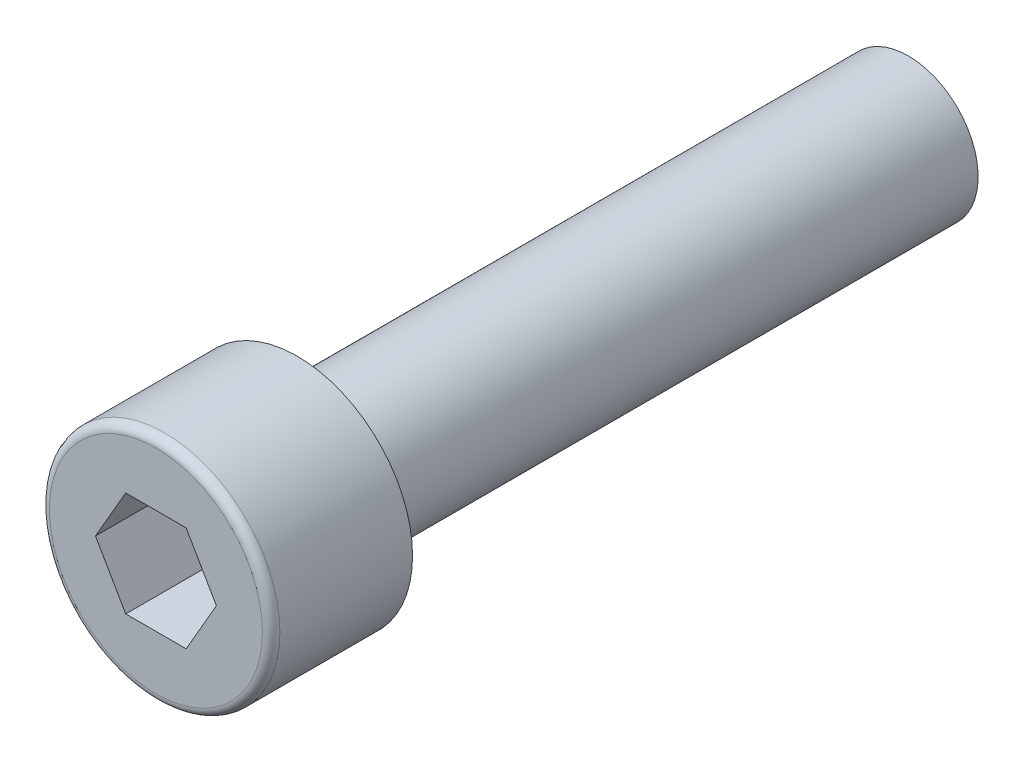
ISO-10303-21;
HEADER;
FILE_DESCRIPTION(('STEP AP214'),'2;1');
FILE_NAME('part.step','',(''),(''),'','','');
FILE_SCHEMA(('AUTOMOTIVE_DESIGN { 1 0 10303 214 1 1 1 1 }'));
ENDSEC;
DATA;
#1=APPLICATION_CONTEXT('core data for automotive mechanical design processes');
#2=APPLICATION_PROTOCOL_DEFINITION('international standard','automotive_design',2000,#1);
#3=PRODUCT_CONTEXT('',#1,'mechanical');
#4=PRODUCT('Part','Part','',(#3));
#5=PRODUCT_RELATED_PRODUCT_CATEGORY('part','',(#4));
#6=PRODUCT_DEFINITION_FORMATION('','',#4);
#7=PRODUCT_DEFINITION_CONTEXT('part definition',#1,'design');
#8=PRODUCT_DEFINITION('design','',#6,#7);
#9=PRODUCT_DEFINITION_SHAPE('','',#8);
#10=(LENGTH_UNIT() NAMED_UNIT(*) SI_UNIT(.MILLI.,.METRE.));
#11=(NAMED_UNIT(*) PLANE_ANGLE_UNIT() SI_UNIT($,.RADIAN.));
#12=(NAMED_UNIT(*) SI_UNIT($,.STERADIAN.) SOLID_ANGLE_UNIT());
#13=UNCERTAINTY_MEASURE_WITH_UNIT(LENGTH_MEASURE(1.E-05),#10,'distance_accuracy_value','');
#14=(GEOMETRIC_REPRESENTATION_CONTEXT(3) GLOBAL_UNCERTAINTY_ASSIGNED_CONTEXT((#13)) GLOBAL_UNIT_ASSIGNED_CONTEXT((#10,
#11,#12)) REPRESENTATION_CONTEXT('',''));
#15=CARTESIAN_POINT('',(0.,0.,0.));
#16=DIRECTION('',(0.,0.,1.));
#17=DIRECTION('',(1.,0.,0.));
#18=AXIS2_PLACEMENT_3D('',#15,#16,#17);
#19=CARTESIAN_POINT('',(0.,0.,-8.1));
#20=DIRECTION('',(0.,0.,1.));
#21=DIRECTION('',(1.,0.,0.));
#22=AXIS2_PLACEMENT_3D('',#19,#20,#21);
#23=CYLINDRICAL_SURFACE('',#22,6.6);
#24=CARTESIAN_POINT('',(0.,0.,-0.5));
#25=DIRECTION('',(0.,0.,1.));
#26=DIRECTION('',(1.,0.,0.));
#27=AXIS2_PLACEMENT_3D('',#24,#25,#26);
#28=CIRCLE('',#27,6.6);
#29=CARTESIAN_POINT('',(6.6,0.,-0.5));
#30=VERTEX_POINT('',#29);
#31=EDGE_CURVE('E11',#30,#30,#28,.F.);
#32=ORIENTED_EDGE('',*,*,#31,.T.);
#33=EDGE_LOOP('',(#32));
#34=FACE_BOUND('',#33,.T.);
#35=CARTESIAN_POINT('',(0.,0.,-8.1));
#36=DIRECTION('',(0.,0.,1.));
#37=DIRECTION('',(1.,0.,0.));
#38=AXIS2_PLACEMENT_3D('',#35,#36,#37);
#39=CIRCLE('',#38,6.6);
#40=CARTESIAN_POINT('',(6.6,0.,-8.1));
#41=VERTEX_POINT('',#40);
#42=EDGE_CURVE('E144',#41,#41,#39,.T.);
#43=ORIENTED_EDGE('',*,*,#42,.T.);
#44=EDGE_LOOP('',(#43));
#45=FACE_BOUND('',#44,.T.);
#46=ADVANCED_FACE('F34',(#34,#45),#23,.T.);
#47=CARTESIAN_POINT('',(0.,0.,-8.1));
#48=DIRECTION('',(0.,0.,1.));
#49=DIRECTION('',(1.,0.,0.));
#50=AXIS2_PLACEMENT_3D('',#47,#48,#49);
#51=PLANE('',#50);
#52=CARTESIAN_POINT('',(0.,0.,-8.1));
#53=DIRECTION('',(0.,0.,-1.));
#54=DIRECTION('',(-1.,0.,0.));
#55=AXIS2_PLACEMENT_3D('',#52,#53,#54);
#56=CIRCLE('',#55,4.);
#57=CARTESIAN_POINT('',(-4.,0.,-8.1));
#58=VERTEX_POINT('',#57);
#59=EDGE_CURVE('E145',#58,#58,#56,.T.);
#60=ORIENTED_EDGE('',*,*,#59,.F.);
#61=EDGE_LOOP('',(#60));
#62=FACE_BOUND('',#61,.T.);
#63=ORIENTED_EDGE('',*,*,#42,.F.);
#64=EDGE_LOOP('',(#63));
#65=FACE_BOUND('',#64,.T.);
#66=ADVANCED_FACE('F164',(#62,#65),#51,.F.);
#67=CARTESIAN_POINT('',(0.,0.,0.));
#68=DIRECTION('',(0.,0.,1.));
#69=DIRECTION('',(1.,0.,0.));
#70=AXIS2_PLACEMENT_3D('',#67,#68,#69);
#71=PLANE('',#70);
#72=CARTESIAN_POINT('',(0.,0.,0.));
#73=DIRECTION('',(0.,0.,1.));
#74=DIRECTION('',(1.,0.,0.));
#75=AXIS2_PLACEMENT_3D('',#72,#73,#74);
#76=CIRCLE('',#75,6.1);
#77=CARTESIAN_POINT('',(6.1,0.,0.));
#78=VERTEX_POINT('',#77);
#79=EDGE_CURVE('E42',#78,#78,#76,.T.);
#80=ORIENTED_EDGE('',*,*,#79,.T.);
#81=EDGE_LOOP('',(#80));
#82=FACE_BOUND('',#81,.T.);
#83=DIRECTION('',(0.5,0.866025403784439,0.));
#84=VECTOR('',#83,1.);
#85=CARTESIAN_POINT('',(1.73205080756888,-3.,0.));
#86=LINE('',#85,#84);
#87=CARTESIAN_POINT('',(1.73205080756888,-3.,0.));
#88=VERTEX_POINT('',#87);
#89=CARTESIAN_POINT('',(3.46410161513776,0.,0.));
#90=VERTEX_POINT('',#89);
#91=EDGE_CURVE('E49',#88,#90,#86,.T.);
#92=ORIENTED_EDGE('',*,*,#91,.F.);
#93=DIRECTION('',(1.,0.,0.));
#94=VECTOR('',#93,1.);
#95=CARTESIAN_POINT('',(-1.73205080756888,-3.,0.));
#96=LINE('',#95,#94);
#97=CARTESIAN_POINT('',(-1.73205080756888,-3.,0.));
#98=VERTEX_POINT('',#97);
#99=EDGE_CURVE('E132',#98,#88,#96,.T.);
#100=ORIENTED_EDGE('',*,*,#99,.F.);
#101=DIRECTION('',(0.5,-0.866025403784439,0.));
#102=VECTOR('',#101,1.);
#103=CARTESIAN_POINT('',(-3.46410161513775,0.,0.));
#104=LINE('',#103,#102);
#105=CARTESIAN_POINT('',(-3.46410161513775,0.,0.));
#106=VERTEX_POINT('',#105);
#107=EDGE_CURVE('E130',#106,#98,#104,.T.);
#108=ORIENTED_EDGE('',*,*,#107,.F.);
#109=DIRECTION('',(-0.5,-0.866025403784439,0.));
#110=VECTOR('',#109,1.);
#111=CARTESIAN_POINT('',(-1.73205080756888,3.,0.));
#112=LINE('',#111,#110);
#113=CARTESIAN_POINT('',(-1.73205080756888,3.,0.));
#114=VERTEX_POINT('',#113);
#115=EDGE_CURVE('E97',#114,#106,#112,.T.);
#116=ORIENTED_EDGE('',*,*,#115,.F.);
#117=DIRECTION('',(-1.,0.,0.));
#118=VECTOR('',#117,1.);
#119=CARTESIAN_POINT('',(1.73205080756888,3.,0.));
#120=LINE('',#119,#118);
#121=CARTESIAN_POINT('',(1.73205080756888,3.,0.));
#122=VERTEX_POINT('',#121);
#123=EDGE_CURVE('E126',#122,#114,#120,.T.);
#124=ORIENTED_EDGE('',*,*,#123,.F.);
#125=DIRECTION('',(-0.5,0.866025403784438,0.));
#126=VECTOR('',#125,1.);
#127=CARTESIAN_POINT('',(3.46410161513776,0.,0.));
#128=LINE('',#127,#126);
#129=EDGE_CURVE('E123',#90,#122,#128,.T.);
#130=ORIENTED_EDGE('',*,*,#129,.F.);
#131=EDGE_LOOP('',(#92,#100,#108,#116,#124,#130));
#132=FACE_BOUND('',#131,.T.);
#133=ADVANCED_FACE('F152',(#82,#132),#71,.T.);
#134=CARTESIAN_POINT('',(0.,0.,-43.1));
#135=DIRECTION('',(0.,0.,1.));
#136=DIRECTION('',(1.,0.,0.));
#137=AXIS2_PLACEMENT_3D('',#134,#135,#136);
#138=CYLINDRICAL_SURFACE('',#137,4.);
#139=CARTESIAN_POINT('',(0.,0.,-43.1));
#140=DIRECTION('',(0.,0.,-1.));
#141=DIRECTION('',(-1.,0.,0.));
#142=AXIS2_PLACEMENT_3D('',#139,#140,#141);
#143=CIRCLE('',#142,4.);
#144=CARTESIAN_POINT('',(-4.,0.,-43.1));
#145=VERTEX_POINT('',#144);
#146=EDGE_CURVE('E136',#145,#145,#143,.T.);
#147=ORIENTED_EDGE('',*,*,#146,.F.);
#148=EDGE_LOOP('',(#147));
#149=FACE_BOUND('',#148,.T.);
#150=ORIENTED_EDGE('',*,*,#59,.T.);
#151=EDGE_LOOP('',(#150));
#152=FACE_BOUND('',#151,.T.);
#153=ADVANCED_FACE('F174',(#149,#152),#138,.T.);
#154=CARTESIAN_POINT('',(0.,0.,-43.1));
#155=DIRECTION('',(0.,0.,-1.));
#156=DIRECTION('',(-1.,0.,0.));
#157=AXIS2_PLACEMENT_3D('',#154,#155,#156);
#158=PLANE('',#157);
#159=ORIENTED_EDGE('',*,*,#146,.T.);
#160=EDGE_LOOP('',(#159));
#161=FACE_BOUND('',#160,.T.);
#162=ADVANCED_FACE('F178',(#161),#158,.T.);
#163=CARTESIAN_POINT('',(1.73205080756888,-3.,-4.5));
#164=DIRECTION('',(0.866025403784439,-0.5,0.));
#165=DIRECTION('',(0.5,0.866025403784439,0.));
#166=AXIS2_PLACEMENT_3D('',#163,#164,#165);
#167=PLANE('',#166);
#168=ORIENTED_EDGE('',*,*,#91,.T.);
#169=DIRECTION('',(0.,0.,1.));
#170=VECTOR('',#169,1.);
#171=CARTESIAN_POINT('',(3.46410161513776,0.,-4.5));
#172=LINE('',#171,#170);
#173=CARTESIAN_POINT('',(3.46410161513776,0.,-4.5));
#174=VERTEX_POINT('',#173);
#175=EDGE_CURVE('E79',#174,#90,#172,.T.);
#176=ORIENTED_EDGE('',*,*,#175,.F.);
#177=DIRECTION('',(0.5,0.866025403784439,0.));
#178=VECTOR('',#177,1.);
#179=CARTESIAN_POINT('',(1.73205080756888,-3.,-4.5));
#180=LINE('',#179,#178);
#181=CARTESIAN_POINT('',(1.73205080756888,-3.,-4.5));
#182=VERTEX_POINT('',#181);
#183=EDGE_CURVE('E134',#182,#174,#180,.T.);
#184=ORIENTED_EDGE('',*,*,#183,.F.);
#185=DIRECTION('',(0.,0.,1.));
#186=VECTOR('',#185,1.);
#187=CARTESIAN_POINT('',(1.73205080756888,-3.,-4.5));
#188=LINE('',#187,#186);
#189=EDGE_CURVE('E57',#182,#88,#188,.T.);
#190=ORIENTED_EDGE('',*,*,#189,.T.);
#191=EDGE_LOOP('',(#168,#176,#184,#190));
#192=FACE_BOUND('',#191,.T.);
#193=ADVANCED_FACE('F182',(#192),#167,.F.);
#194=CARTESIAN_POINT('',(-1.73205080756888,-3.,-4.5));
#195=DIRECTION('',(0.,-1.,0.));
#196=DIRECTION('',(0.,0.,-1.));
#197=AXIS2_PLACEMENT_3D('',#194,#195,#196);
#198=PLANE('',#197);
#199=ORIENTED_EDGE('',*,*,#99,.T.);
#200=ORIENTED_EDGE('',*,*,#189,.F.);
#201=DIRECTION('',(1.,0.,0.));
#202=VECTOR('',#201,1.);
#203=CARTESIAN_POINT('',(-1.73205080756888,-3.,-4.5));
#204=LINE('',#203,#202);
#205=CARTESIAN_POINT('',(-1.73205080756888,-3.,-4.5));
#206=VERTEX_POINT('',#205);
#207=EDGE_CURVE('E109',#206,#182,#204,.T.);
#208=ORIENTED_EDGE('',*,*,#207,.F.);
#209=DIRECTION('',(0.,0.,1.));
#210=VECTOR('',#209,1.);
#211=CARTESIAN_POINT('',(-1.73205080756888,-3.,-4.5));
#212=LINE('',#211,#210);
#213=EDGE_CURVE('E101',#206,#98,#212,.T.);
#214=ORIENTED_EDGE('',*,*,#213,.T.);
#215=EDGE_LOOP('',(#199,#200,#208,#214));
#216=FACE_BOUND('',#215,.T.);
#217=ADVANCED_FACE('F186',(#216),#198,.F.);
#218=CARTESIAN_POINT('',(-3.46410161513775,0.,-4.5));
#219=DIRECTION('',(-0.866025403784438,-0.5,0.));
#220=DIRECTION('',(0.5,-0.866025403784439,0.));
#221=AXIS2_PLACEMENT_3D('',#218,#219,#220);
#222=PLANE('',#221);
#223=ORIENTED_EDGE('',*,*,#107,.T.);
#224=ORIENTED_EDGE('',*,*,#213,.F.);
#225=DIRECTION('',(0.5,-0.866025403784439,0.));
#226=VECTOR('',#225,1.);
#227=CARTESIAN_POINT('',(-3.46410161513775,0.,-4.5));
#228=LINE('',#227,#226);
#229=CARTESIAN_POINT('',(-3.46410161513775,0.,-4.5));
#230=VERTEX_POINT('',#229);
#231=EDGE_CURVE('E105',#230,#206,#228,.T.);
#232=ORIENTED_EDGE('',*,*,#231,.F.);
#233=DIRECTION('',(0.,0.,1.));
#234=VECTOR('',#233,1.);
#235=CARTESIAN_POINT('',(-3.46410161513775,0.,-4.5));
#236=LINE('',#235,#234);
#237=EDGE_CURVE('E90',#230,#106,#236,.T.);
#238=ORIENTED_EDGE('',*,*,#237,.T.);
#239=EDGE_LOOP('',(#223,#224,#232,#238));
#240=FACE_BOUND('',#239,.T.);
#241=ADVANCED_FACE('F106',(#240),#222,.F.);
#242=CARTESIAN_POINT('',(-1.73205080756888,3.,-4.5));
#243=DIRECTION('',(-0.866025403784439,0.5,0.));
#244=DIRECTION('',(-0.5,-0.866025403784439,0.));
#245=AXIS2_PLACEMENT_3D('',#242,#243,#244);
#246=PLANE('',#245);
#247=ORIENTED_EDGE('',*,*,#115,.T.);
#248=ORIENTED_EDGE('',*,*,#237,.F.);
#249=DIRECTION('',(-0.5,-0.866025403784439,0.));
#250=VECTOR('',#249,1.);
#251=CARTESIAN_POINT('',(-1.73205080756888,3.,-4.5));
#252=LINE('',#251,#250);
#253=CARTESIAN_POINT('',(-1.73205080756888,3.,-4.5));
#254=VERTEX_POINT('',#253);
#255=EDGE_CURVE('E94',#254,#230,#252,.T.);
#256=ORIENTED_EDGE('',*,*,#255,.F.);
#257=DIRECTION('',(0.,0.,1.));
#258=VECTOR('',#257,1.);
#259=CARTESIAN_POINT('',(-1.73205080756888,3.,-4.5));
#260=LINE('',#259,#258);
#261=EDGE_CURVE('E102',#254,#114,#260,.T.);
#262=ORIENTED_EDGE('',*,*,#261,.T.);
#263=EDGE_LOOP('',(#247,#248,#256,#262));
#264=FACE_BOUND('',#263,.T.);
#265=ADVANCED_FACE('F92',(#264),#246,.F.);
#266=CARTESIAN_POINT('',(1.73205080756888,3.,-4.5));
#267=DIRECTION('',(0.,1.,0.));
#268=DIRECTION('',(0.,0.,1.));
#269=AXIS2_PLACEMENT_3D('',#266,#267,#268);
#270=PLANE('',#269);
#271=ORIENTED_EDGE('',*,*,#123,.T.);
#272=ORIENTED_EDGE('',*,*,#261,.F.);
#273=DIRECTION('',(-1.,0.,0.));
#274=VECTOR('',#273,1.);
#275=CARTESIAN_POINT('',(1.73205080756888,3.,-4.5));
#276=LINE('',#275,#274);
#277=CARTESIAN_POINT('',(1.73205080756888,3.,-4.5));
#278=VERTEX_POINT('',#277);
#279=EDGE_CURVE('E115',#278,#254,#276,.T.);
#280=ORIENTED_EDGE('',*,*,#279,.F.);
#281=DIRECTION('',(0.,0.,1.));
#282=VECTOR('',#281,1.);
#283=CARTESIAN_POINT('',(1.73205080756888,3.,-4.5));
#284=LINE('',#283,#282);
#285=EDGE_CURVE('E139',#278,#122,#284,.T.);
#286=ORIENTED_EDGE('',*,*,#285,.T.);
#287=EDGE_LOOP('',(#271,#272,#280,#286));
#288=FACE_BOUND('',#287,.T.);
#289=ADVANCED_FACE('F189',(#288),#270,.F.);
#290=CARTESIAN_POINT('',(3.46410161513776,0.,-4.5));
#291=DIRECTION('',(0.866025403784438,0.5,0.));
#292=DIRECTION('',(-0.5,0.866025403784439,0.));
#293=AXIS2_PLACEMENT_3D('',#290,#291,#292);
#294=PLANE('',#293);
#295=ORIENTED_EDGE('',*,*,#129,.T.);
#296=ORIENTED_EDGE('',*,*,#285,.F.);
#297=DIRECTION('',(-0.5,0.866025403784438,0.));
#298=VECTOR('',#297,1.);
#299=CARTESIAN_POINT('',(3.46410161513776,0.,-4.5));
#300=LINE('',#299,#298);
#301=EDGE_CURVE('E117',#174,#278,#300,.T.);
#302=ORIENTED_EDGE('',*,*,#301,.F.);
#303=ORIENTED_EDGE('',*,*,#175,.T.);
#304=EDGE_LOOP('',(#295,#296,#302,#303));
#305=FACE_BOUND('',#304,.T.);
#306=ADVANCED_FACE('F160',(#305),#294,.F.);
#307=CARTESIAN_POINT('',(0.,0.,-4.5));
#308=DIRECTION('',(0.,0.,1.));
#309=DIRECTION('',(1.,0.,0.));
#310=AXIS2_PLACEMENT_3D('',#307,#308,#309);
#311=PLANE('',#310);
#312=ORIENTED_EDGE('',*,*,#183,.T.);
#313=ORIENTED_EDGE('',*,*,#301,.T.);
#314=ORIENTED_EDGE('',*,*,#279,.T.);
#315=ORIENTED_EDGE('',*,*,#255,.T.);
#316=ORIENTED_EDGE('',*,*,#231,.T.);
#317=ORIENTED_EDGE('',*,*,#207,.T.);
#318=EDGE_LOOP('',(#312,#313,#314,#315,#316,#317));
#319=FACE_BOUND('',#318,.T.);
#320=ADVANCED_FACE('F112',(#319),#311,.T.);
#321=CARTESIAN_POINT('',(0.,0.,-0.5));
#322=DIRECTION('',(0.,0.,1.));
#323=DIRECTION('',(1.,0.,0.));
#324=AXIS2_PLACEMENT_3D('',#321,#322,#323);
#325=TOROIDAL_SURFACE('',#324,6.1,0.5);
#326=ORIENTED_EDGE('',*,*,#31,.F.);
#327=EDGE_LOOP('',(#326));
#328=FACE_BOUND('',#327,.T.);
#329=ORIENTED_EDGE('',*,*,#79,.F.);
#330=EDGE_LOOP('',(#329));
#331=FACE_BOUND('',#330,.T.);
#332=ADVANCED_FACE('F36',(#328,#331),#325,.T.);
#333=CLOSED_SHELL('',(#46,#66,#133,#153,#162,#193,#217,#241,#265,#289,#306,#320,#332));
#334=MANIFOLD_SOLID_BREP('B2',#333);
#335=ADVANCED_BREP_SHAPE_REPRESENTATION('',(#18,#334),#14);
#336=SHAPE_DEFINITION_REPRESENTATION(#9,#335);
ENDSEC;
END-ISO-10303-21;
